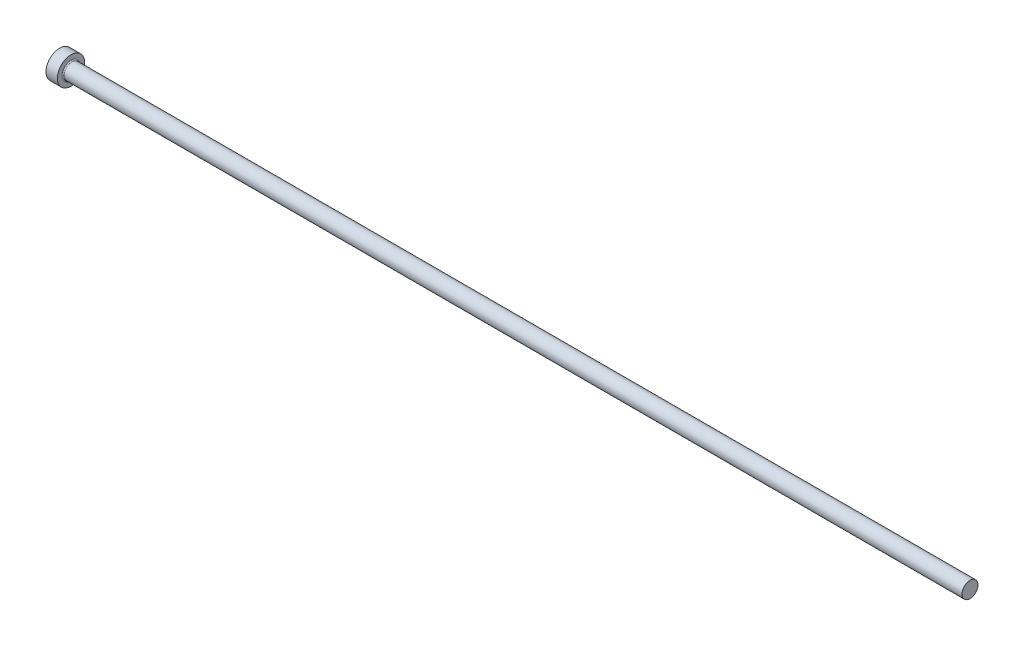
ISO-10303-21;
HEADER;
FILE_DESCRIPTION(('STEP AP214'),'2;1');
FILE_NAME('part.step','',(''),(''),'','','');
FILE_SCHEMA(('AUTOMOTIVE_DESIGN { 1 0 10303 214 1 1 1 1 }'));
ENDSEC;
DATA;
#1=APPLICATION_CONTEXT('core data for automotive mechanical design processes');
#2=APPLICATION_PROTOCOL_DEFINITION('international standard','automotive_design',2000,#1);
#3=PRODUCT_CONTEXT('',#1,'mechanical');
#4=PRODUCT('Part','Part','',(#3));
#5=PRODUCT_RELATED_PRODUCT_CATEGORY('part','',(#4));
#6=PRODUCT_DEFINITION_FORMATION('','',#4);
#7=PRODUCT_DEFINITION_CONTEXT('part definition',#1,'design');
#8=PRODUCT_DEFINITION('design','',#6,#7);
#9=PRODUCT_DEFINITION_SHAPE('','',#8);
#10=(LENGTH_UNIT() NAMED_UNIT(*) SI_UNIT(.MILLI.,.METRE.));
#11=(NAMED_UNIT(*) PLANE_ANGLE_UNIT() SI_UNIT($,.RADIAN.));
#12=(NAMED_UNIT(*) SI_UNIT($,.STERADIAN.) SOLID_ANGLE_UNIT());
#13=UNCERTAINTY_MEASURE_WITH_UNIT(LENGTH_MEASURE(1.E-05),#10,'distance_accuracy_value','');
#14=(GEOMETRIC_REPRESENTATION_CONTEXT(3) GLOBAL_UNCERTAINTY_ASSIGNED_CONTEXT((#13)) GLOBAL_UNIT_ASSIGNED_CONTEXT((#10,
#11,#12)) REPRESENTATION_CONTEXT('',''));
#15=CARTESIAN_POINT('',(0.,0.,0.));
#16=DIRECTION('',(0.,0.,1.));
#17=DIRECTION('',(1.,0.,0.));
#18=AXIS2_PLACEMENT_3D('',#15,#16,#17);
#19=CARTESIAN_POINT('',(0.,0.,0.));
#20=DIRECTION('',(-1.,0.,0.));
#21=DIRECTION('',(0.,-1.,0.));
#22=AXIS2_PLACEMENT_3D('',#19,#20,#21);
#23=PLANE('',#22);
#24=CARTESIAN_POINT('',(0.,0.,0.));
#25=DIRECTION('',(1.,0.,0.));
#26=DIRECTION('',(0.,1.,0.));
#27=AXIS2_PLACEMENT_3D('',#24,#25,#26);
#28=CIRCLE('',#27,6.);
#29=CARTESIAN_POINT('',(0.,6.,0.));
#30=VERTEX_POINT('',#29);
#31=EDGE_CURVE('E25',#30,#30,#28,.T.);
#32=ORIENTED_EDGE('',*,*,#31,.F.);
#33=EDGE_LOOP('',(#32));
#34=FACE_BOUND('',#33,.T.);
#35=ADVANCED_FACE('F14',(#34),#23,.T.);
#36=CARTESIAN_POINT('',(400.,0.,0.));
#37=DIRECTION('',(1.,0.,0.));
#38=DIRECTION('',(0.,1.,0.));
#39=AXIS2_PLACEMENT_3D('',#36,#37,#38);
#40=CYLINDRICAL_SURFACE('',#39,6.);
#41=ORIENTED_EDGE('',*,*,#31,.T.);
#42=EDGE_LOOP('',(#41));
#43=FACE_BOUND('',#42,.T.);
#44=CARTESIAN_POINT('',(5.,0.,0.));
#45=DIRECTION('',(1.,0.,0.));
#46=DIRECTION('',(0.,1.,0.));
#47=AXIS2_PLACEMENT_3D('',#44,#45,#46);
#48=CIRCLE('',#47,6.);
#49=CARTESIAN_POINT('',(5.,6.,0.));
#50=VERTEX_POINT('',#49);
#51=EDGE_CURVE('E29',#50,#50,#48,.T.);
#52=ORIENTED_EDGE('',*,*,#51,.F.);
#53=EDGE_LOOP('',(#52));
#54=FACE_BOUND('',#53,.T.);
#55=ADVANCED_FACE('F51',(#43,#54),#40,.T.);
#56=CARTESIAN_POINT('',(5.,6.,0.));
#57=DIRECTION('',(1.,0.,0.));
#58=DIRECTION('',(0.,1.,0.));
#59=AXIS2_PLACEMENT_3D('',#56,#57,#58);
#60=PLANE('',#59);
#61=CARTESIAN_POINT('',(5.,0.,0.));
#62=DIRECTION('',(1.,0.,0.));
#63=DIRECTION('',(0.,1.,0.));
#64=AXIS2_PLACEMENT_3D('',#61,#62,#63);
#65=CIRCLE('',#64,4.);
#66=CARTESIAN_POINT('',(5.,4.,0.));
#67=VERTEX_POINT('',#66);
#68=EDGE_CURVE('E9',#67,#67,#65,.F.);
#69=ORIENTED_EDGE('',*,*,#68,.T.);
#70=EDGE_LOOP('',(#69));
#71=FACE_BOUND('',#70,.T.);
#72=ORIENTED_EDGE('',*,*,#51,.T.);
#73=EDGE_LOOP('',(#72));
#74=FACE_BOUND('',#73,.T.);
#75=ADVANCED_FACE('F42',(#71,#74),#60,.T.);
#76=CARTESIAN_POINT('',(400.,0.,0.));
#77=DIRECTION('',(1.,0.,0.));
#78=DIRECTION('',(0.,1.,0.));
#79=AXIS2_PLACEMENT_3D('',#76,#77,#78);
#80=CYLINDRICAL_SURFACE('',#79,3.49999999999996);
#81=CARTESIAN_POINT('',(5.5,0.,0.));
#82=DIRECTION('',(1.,0.,0.));
#83=DIRECTION('',(0.,1.,0.));
#84=AXIS2_PLACEMENT_3D('',#81,#82,#83);
#85=CIRCLE('',#84,3.49999999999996);
#86=CARTESIAN_POINT('',(5.5,3.49999999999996,0.));
#87=VERTEX_POINT('',#86);
#88=EDGE_CURVE('E21',#87,#87,#85,.T.);
#89=ORIENTED_EDGE('',*,*,#88,.T.);
#90=EDGE_LOOP('',(#89));
#91=FACE_BOUND('',#90,.T.);
#92=CARTESIAN_POINT('',(400.,0.,0.));
#93=DIRECTION('',(1.,0.,0.));
#94=DIRECTION('',(0.,1.,0.));
#95=AXIS2_PLACEMENT_3D('',#92,#93,#94);
#96=CIRCLE('',#95,3.49999999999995);
#97=CARTESIAN_POINT('',(400.,3.49999999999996,0.));
#98=VERTEX_POINT('',#97);
#99=EDGE_CURVE('E34',#98,#98,#96,.T.);
#100=ORIENTED_EDGE('',*,*,#99,.F.);
#101=EDGE_LOOP('',(#100));
#102=FACE_BOUND('',#101,.T.);
#103=ADVANCED_FACE('F40',(#91,#102),#80,.T.);
#104=CARTESIAN_POINT('',(400.,3.49999999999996,0.));
#105=DIRECTION('',(1.,0.,0.));
#106=DIRECTION('',(0.,1.,0.));
#107=AXIS2_PLACEMENT_3D('',#104,#105,#106);
#108=PLANE('',#107);
#109=ORIENTED_EDGE('',*,*,#99,.T.);
#110=EDGE_LOOP('',(#109));
#111=FACE_BOUND('',#110,.T.);
#112=ADVANCED_FACE('F38',(#111),#108,.T.);
#113=CARTESIAN_POINT('',(5.5,0.,0.));
#114=DIRECTION('',(1.,0.,0.));
#115=DIRECTION('',(0.,1.,0.));
#116=AXIS2_PLACEMENT_3D('',#113,#114,#115);
#117=TOROIDAL_SURFACE('',#116,4.,0.5);
#118=ORIENTED_EDGE('',*,*,#68,.F.);
#119=EDGE_LOOP('',(#118));
#120=FACE_BOUND('',#119,.T.);
#121=ORIENTED_EDGE('',*,*,#88,.F.);
#122=EDGE_LOOP('',(#121));
#123=FACE_BOUND('',#122,.T.);
#124=ADVANCED_FACE('F16',(#120,#123),#117,.F.);
#125=CLOSED_SHELL('',(#35,#55,#75,#103,#112,#124));
#126=MANIFOLD_SOLID_BREP('B1',#125);
#127=ADVANCED_BREP_SHAPE_REPRESENTATION('',(#18,#126),#14);
#128=SHAPE_DEFINITION_REPRESENTATION(#9,#127);
ENDSEC;
END-ISO-10303-21;
